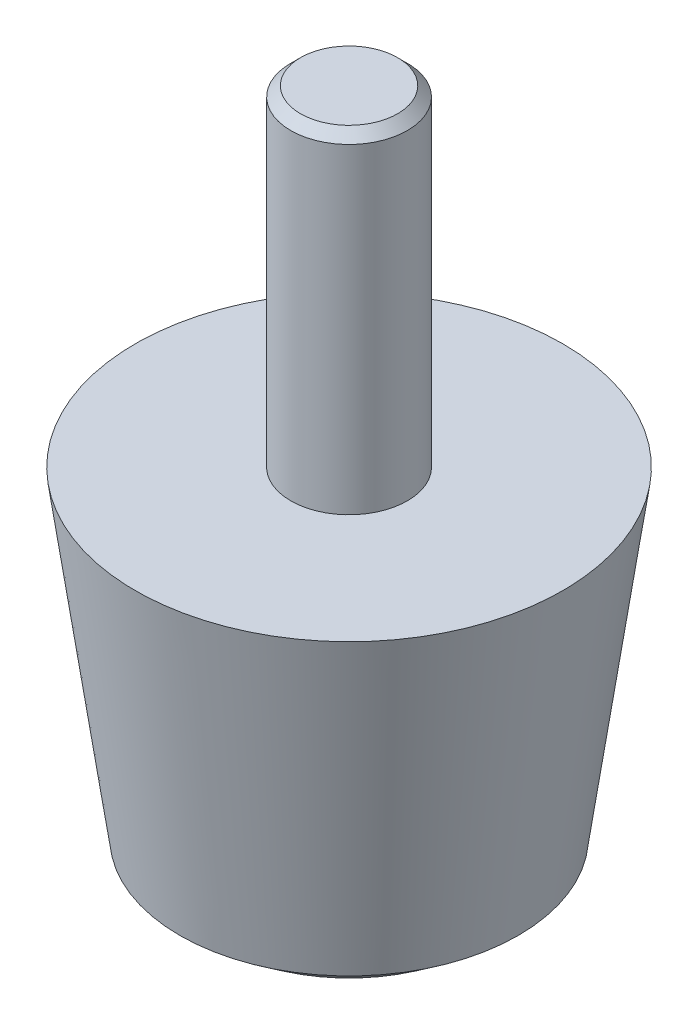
from build123d import *

# Parameters (mm, degrees)
CHANFREIN1_SIZE  = 1.5
CHANFREIN1_SIZE2 = 1.758656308
ESQUISSE2_R      = 3
EXTRUSION1_DEPTH = 17
CHANFREIN2_SIZE  = 0.5


with BuildPart() as part:
    # Esquisse1 → R_volution1 (revolve)
    with BuildSketch(Plane.XY, mode=Mode.PRIVATE) as r_volution1_sk:
        Polygon((0, 0), (0, 18), (11, 18), (8.5, 0), align=None)
    revolve(r_volution1_sk.sketch.rotate(Axis((0, -8.303846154, 0), (0, 1, 0)), 90), axis=Axis((0, -8.303846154, 0), (0, 1, 0)))

    # Chanfrein1
    chanfrein1_edges = [part.edges().sort_by_distance(p)[0] for p in [
        (0, 0, 8.5),
    ]]
    chanfrein1_side = [part.faces().sort_by_distance(p)[0] for p in [
        (0, 9, 9.75),
    ]]
    chamfer(chanfrein1_edges, length=CHANFREIN1_SIZE, length2=CHANFREIN1_SIZE2, reference=chanfrein1_side[0])

    # Esquisse2 → Extrusion1 (add)
    with BuildSketch(Plane(origin=(0, 18, 0), x_dir=(1, 0, 0), z_dir=(0, 1, 0))):
        with Locations(Location((0, 0, 0), (0, 0, 270))):
            Circle(ESQUISSE2_R)
    extrude(amount=EXTRUSION1_DEPTH)

    # Chanfrein2
    chanfrein2_edges = [part.edges().sort_by_distance(p)[0] for p in [
        (0, 35, -3),
    ]]
    chamfer(chanfrein2_edges, length=CHANFREIN2_SIZE)


solid = part.part
